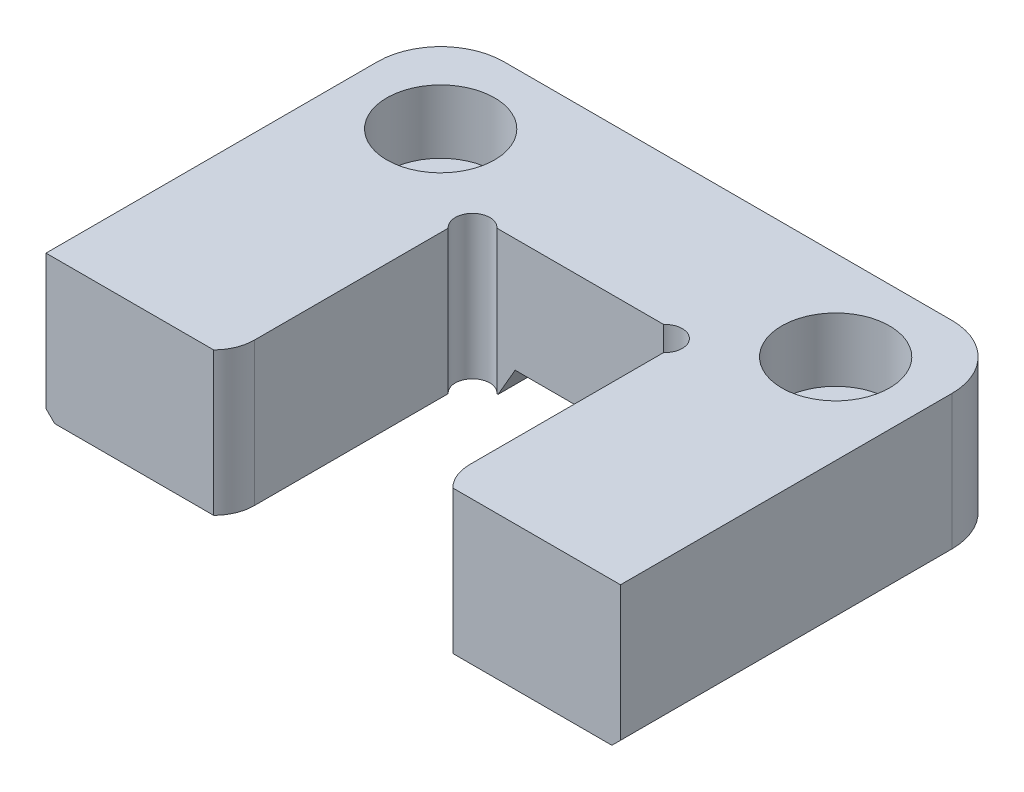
from build123d import *

# Parameters (mm, degrees)
BOSS_EXTRUDE1_DEPTH    = 12.6746
FILLET1_R              = 5.588
CUT_EXTRUDE1_DEPTH     = 45.986526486
SKETCH3_R              = 1.524
CUT_EXTRUDE2_DEPTH     = 45.986526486
CUT_EXTRUDE3_DEPTH     = 45.986526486
CHAMFER1_SIZE          = 0.762
CHAMFER5_SIZE          = 3.81
CHAMFER5_SIZE2         = 1.020886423
F_10_CBORE_D           = 5.1054
F_10_CBORE_CBORE_D     = 9.525
F_10_CBORE_CBORE_DEPTH = 5.61975


with BuildPart() as part:
    # Sketch1 → Boss-Extrude1 (new body)
    with BuildSketch(Plane(origin=(0, 0, 0), x_dir=(1, 0, 0), z_dir=(0, 1, 0))):
        Polygon((9.525, 0), (25.4, 0), (25.4, 34.8996), (-25.4, 34.8996), (-25.4, 0), (-9.525, 0), (-9.525, 21.844), (9.525, 21.844), align=None)
    extrude(amount=-BOSS_EXTRUDE1_DEPTH)

    # Fillet1
    fillet1_edges = [part.edges().sort_by_distance(p)[0] for p in [
        (-25.4, -6.3373, -34.8996),
        (25.4, -6.3373, -34.8996),
    ]]
    fillet(fillet1_edges, radius=FILLET1_R)

    # Sketch2 → Cut-Extrude1 (cut, through all)
    with BuildSketch(Plane(origin=(0, 0, 0), x_dir=(1, 0, 0), z_dir=(0, 1, 0))):
        with BuildLine():
            Line((-9.525, 2.54), (-9.525, 12.7))
            Line((-9.525, 12.7), (9.525, 12.7))
            Line((9.525, 12.7), (9.525, 2.54))
            ThreePointArc((9.525, 2.54), (9.798518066, 1.165303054), (10.577409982, 0))
            Line((10.577409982, 0), (15.875, 0))
            Line((15.875, 0), (15.875, -12.7))
            Line((15.875, -12.7), (-15.875, -12.7))
            Line((-15.875, -12.7), (-15.875, 0))
            Line((-15.875, 0), (-10.577409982, 0))
            ThreePointArc((-10.577409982, 0), (-9.798518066, 1.165303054), (-9.525, 2.54))
        make_face()
    extrude(amount=-CUT_EXTRUDE1_DEPTH, mode=Mode.SUBTRACT)

    # Sketch3 → Cut-Extrude2 (cut, through all)
    with BuildSketch(Plane(origin=(0, 0, 0), x_dir=(1, 0, 0), z_dir=(0, 1, 0))):
        with Locations((-8.509, 20.828)):
            Circle(SKETCH3_R)
        with Locations((8.509, 20.828)):
            Circle(SKETCH3_R)
    extrude(amount=-CUT_EXTRUDE2_DEPTH, mode=Mode.SUBTRACT)

    # Sketch5 → Cut-Extrude3 (cut, through all)
    with BuildSketch(Plane(origin=(0, 0, -34.8996), x_dir=(-1, 0, 0), z_dir=(0, 0, -1))):
        Polygon((-6.35, -11.0871), (6.35, -11.0871), (7.266543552, -12.6746), (-7.266543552, -12.6746), align=None)
    extrude(amount=-CUT_EXTRUDE3_DEPTH, mode=Mode.SUBTRACT)

    # Chamfer1
    chamfer1_edges = [part.edges().sort_by_distance(p)[0] for p in [
        (25.4, -12.6746, -14.6558),
        (13.539271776, -12.6746, -34.8996),
        (-25.4, -12.6746, -14.6558),
        (-23.763312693, -12.6746, -33.262912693),
        (23.763312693, -12.6746, -33.262912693),
        (-13.539271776, -12.6746, -34.8996),
    ]]
    chamfer(chamfer1_edges, length=CHAMFER1_SIZE)

    # Chamfer5
    chamfer5_edges = [part.edges().sort_by_distance(p)[0] for p in [
        (0, -11.0871, -21.844),
    ]]
    chamfer5_side = [part.faces().sort_by_distance(p)[0] for p in [
        (0, -11.0871, -28.3718),
    ]]
    chamfer(chamfer5_edges, length=CHAMFER5_SIZE, length2=CHAMFER5_SIZE2, reference=chamfer5_side[0])

    # 10 CBORE (through all)
    with Locations(Plane(origin=(9.083120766, 0, -5.226040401), x_dir=(-1, 0, 0), z_dir=(0, 1, 0))):
        with Locations((26.545620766, -21.736059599), (-8.379379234, -21.736059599)):
            CounterBoreHole(F_10_CBORE_D / 2, F_10_CBORE_CBORE_D / 2, F_10_CBORE_CBORE_DEPTH)


solid = part.part
